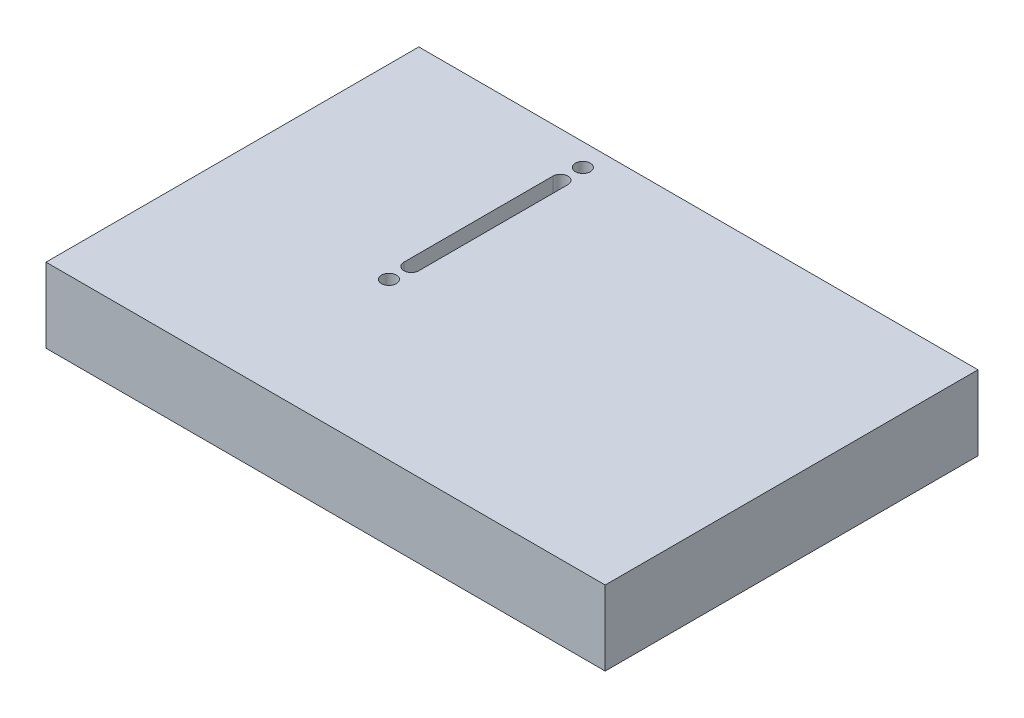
from build123d import *

# Parameters (mm, degrees)
SKETCH1_W           = 19.05
SKETCH1_H           = 12.7
BOSS_EXTRUDE1_DEPTH = 2.54
SKETCH2_R           = 0.254
CUT_EXTRUDE1_DEPTH  = 12.726027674


with BuildPart() as part:
    # Sketch1 → Boss-Extrude1 (new body)
    with BuildSketch(Plane(origin=(0, 0, 0), x_dir=(1, 0, 0), z_dir=(0, 1, 0))):
        Rectangle(SKETCH1_W, SKETCH1_H)
    extrude(amount=BOSS_EXTRUDE1_DEPTH)

    # Sketch2 → Cut-Extrude1 (cut, through all)
    with BuildSketch(Plane(origin=(0, 2.54, 0), x_dir=(1, 0, 0), z_dir=(0, 1, 0))):
        with Locations(Location((-3.175, -1.016, 0), (0, 0, 270))):
            Circle(SKETCH2_R)
        with Locations(Location((-3.175, 5.588, 0), (0, 0, 90))):
            Circle(SKETCH2_R)
        with BuildLine():
            Line((-2.921, 4.826), (-2.921, -0.254))
            ThreePointArc((-2.921, -0.254), (-3.175, -0.508), (-3.429, -0.254))
            Line((-3.429, -0.254), (-3.429, 4.826))
            ThreePointArc((-3.429, 4.826), (-3.175, 5.08), (-2.921, 4.826))
        make_face()
    extrude(amount=-CUT_EXTRUDE1_DEPTH, mode=Mode.SUBTRACT)


solid = part.part
